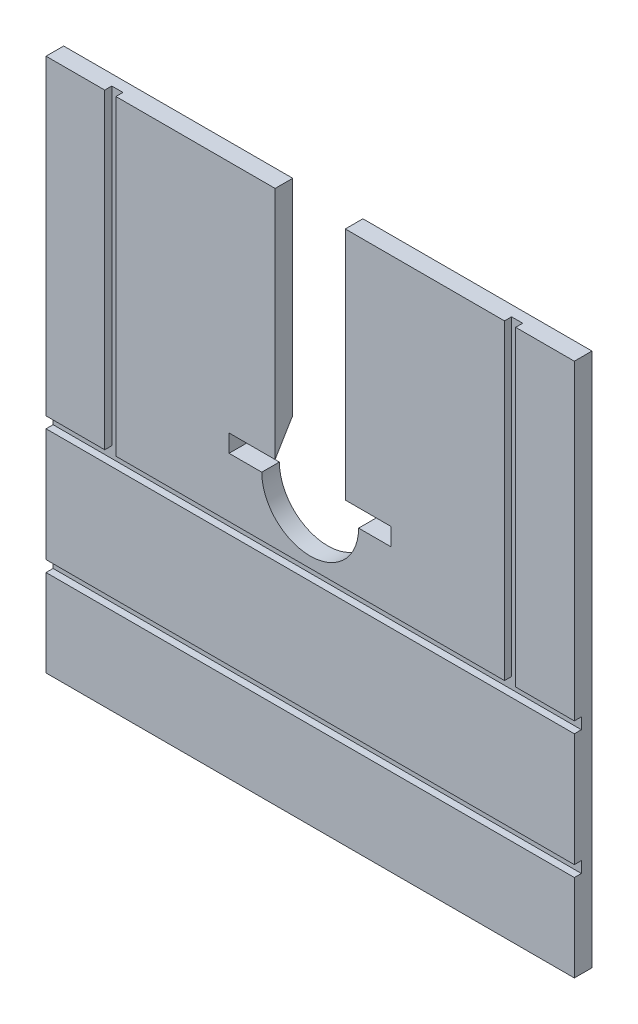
ISO-10303-21;
HEADER;
FILE_DESCRIPTION(('STEP AP214'),'2;1');
FILE_NAME('part.step','',(''),(''),'','','');
FILE_SCHEMA(('AUTOMOTIVE_DESIGN { 1 0 10303 214 1 1 1 1 }'));
ENDSEC;
DATA;
#1=APPLICATION_CONTEXT('core data for automotive mechanical design processes');
#2=APPLICATION_PROTOCOL_DEFINITION('international standard','automotive_design',2000,#1);
#3=PRODUCT_CONTEXT('',#1,'mechanical');
#4=PRODUCT('Part','Part','',(#3));
#5=PRODUCT_RELATED_PRODUCT_CATEGORY('part','',(#4));
#6=PRODUCT_DEFINITION_FORMATION('','',#4);
#7=PRODUCT_DEFINITION_CONTEXT('part definition',#1,'design');
#8=PRODUCT_DEFINITION('design','',#6,#7);
#9=PRODUCT_DEFINITION_SHAPE('','',#8);
#10=(LENGTH_UNIT() NAMED_UNIT(*) SI_UNIT(.MILLI.,.METRE.));
#11=(NAMED_UNIT(*) PLANE_ANGLE_UNIT() SI_UNIT($,.RADIAN.));
#12=(NAMED_UNIT(*) SI_UNIT($,.STERADIAN.) SOLID_ANGLE_UNIT());
#13=UNCERTAINTY_MEASURE_WITH_UNIT(LENGTH_MEASURE(1.E-05),#10,'distance_accuracy_value','');
#14=(GEOMETRIC_REPRESENTATION_CONTEXT(3) GLOBAL_UNCERTAINTY_ASSIGNED_CONTEXT((#13)) GLOBAL_UNIT_ASSIGNED_CONTEXT((#10,
#11,#12)) REPRESENTATION_CONTEXT('',''));
#15=CARTESIAN_POINT('',(0.,0.,0.));
#16=DIRECTION('',(0.,0.,1.));
#17=DIRECTION('',(1.,0.,0.));
#18=AXIS2_PLACEMENT_3D('',#15,#16,#17);
#19=CARTESIAN_POINT('',(0.,0.,30.));
#20=DIRECTION('',(0.,0.,1.));
#21=DIRECTION('',(1.,0.,0.));
#22=AXIS2_PLACEMENT_3D('',#19,#20,#21);
#23=PLANE('',#22);
#24=DIRECTION('',(0.,-1.,0.));
#25=VECTOR('',#24,1.);
#26=CARTESIAN_POINT('',(330.998590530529,-100.709392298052,30.));
#27=LINE('',#26,#25);
#28=CARTESIAN_POINT('',(330.998590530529,430.000000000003,30.));
#29=VERTEX_POINT('',#28);
#30=CARTESIAN_POINT('',(330.998590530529,-100.709392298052,30.));
#31=VERTEX_POINT('',#30);
#32=EDGE_CURVE('E368',#29,#31,#27,.T.);
#33=ORIENTED_EDGE('',*,*,#32,.F.);
#34=DIRECTION('',(-1.,0.,0.));
#35=VECTOR('',#34,1.);
#36=CARTESIAN_POINT('',(450.,430.000000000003,30.));
#37=LINE('',#36,#35);
#38=CARTESIAN_POINT('',(59.776582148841,430.000000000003,30.));
#39=VERTEX_POINT('',#38);
#40=EDGE_CURVE('E376',#29,#39,#37,.T.);
#41=ORIENTED_EDGE('',*,*,#40,.T.);
#42=DIRECTION('',(0.,-1.,0.));
#43=VECTOR('',#42,1.);
#44=CARTESIAN_POINT('',(59.776582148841,430.000000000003,30.));
#45=LINE('',#44,#43);
#46=CARTESIAN_POINT('',(59.776582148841,30.000000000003,30.));
#47=VERTEX_POINT('',#46);
#48=EDGE_CURVE('E414',#39,#47,#45,.T.);
#49=ORIENTED_EDGE('',*,*,#48,.T.);
#50=DIRECTION('',(1.,0.,0.));
#51=VECTOR('',#50,1.);
#52=CARTESIAN_POINT('',(59.776582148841,30.000000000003,30.));
#53=LINE('',#52,#51);
#54=CARTESIAN_POINT('',(82.776582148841,30.000000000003,30.));
#55=VERTEX_POINT('',#54);
#56=EDGE_CURVE('E417',#47,#55,#53,.T.);
#57=ORIENTED_EDGE('',*,*,#56,.T.);
#58=CARTESIAN_POINT('',(137.776582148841,30.000000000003,30.));
#59=VERTEX_POINT('',#58);
#60=EDGE_CURVE('E416',#55,#59,#53,.T.);
#61=ORIENTED_EDGE('',*,*,#60,.T.);
#62=DIRECTION('',(0.,-1.,0.));
#63=VECTOR('',#62,1.);
#64=CARTESIAN_POINT('',(137.776582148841,30.000000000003,30.));
#65=LINE('',#64,#63);
#66=CARTESIAN_POINT('',(137.776582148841,0.,30.));
#67=VERTEX_POINT('',#66);
#68=EDGE_CURVE('E420',#59,#67,#65,.T.);
#69=ORIENTED_EDGE('',*,*,#68,.T.);
#70=DIRECTION('',(-1.,0.,0.));
#71=VECTOR('',#70,1.);
#72=CARTESIAN_POINT('',(137.776582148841,0.,30.));
#73=LINE('',#72,#71);
#74=CARTESIAN_POINT('',(82.5,0.,30.));
#75=VERTEX_POINT('',#74);
#76=EDGE_CURVE('E422',#67,#75,#73,.T.);
#77=ORIENTED_EDGE('',*,*,#76,.T.);
#78=CARTESIAN_POINT('',(0.,0.,30.));
#79=DIRECTION('',(0.,0.,-1.));
#80=DIRECTION('',(1.,0.,0.));
#81=AXIS2_PLACEMENT_3D('',#78,#79,#80);
#82=CIRCLE('',#81,82.5);
#83=CARTESIAN_POINT('',(-82.5,0.,30.));
#84=VERTEX_POINT('',#83);
#85=EDGE_CURVE('E424',#75,#84,#82,.T.);
#86=ORIENTED_EDGE('',*,*,#85,.T.);
#87=DIRECTION('',(-1.,0.,0.));
#88=VECTOR('',#87,1.);
#89=CARTESIAN_POINT('',(-138.223417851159,0.,30.));
#90=LINE('',#89,#88);
#91=CARTESIAN_POINT('',(-138.223417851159,0.,30.));
#92=VERTEX_POINT('',#91);
#93=EDGE_CURVE('E426',#84,#92,#90,.T.);
#94=ORIENTED_EDGE('',*,*,#93,.T.);
#95=DIRECTION('',(0.,1.,0.));
#96=VECTOR('',#95,1.);
#97=CARTESIAN_POINT('',(-138.223417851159,30.000000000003,30.));
#98=LINE('',#97,#96);
#99=CARTESIAN_POINT('',(-138.223417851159,30.000000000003,30.));
#100=VERTEX_POINT('',#99);
#101=EDGE_CURVE('E428',#92,#100,#98,.T.);
#102=ORIENTED_EDGE('',*,*,#101,.T.);
#103=DIRECTION('',(1.,0.,0.));
#104=VECTOR('',#103,1.);
#105=CARTESIAN_POINT('',(-59.776582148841,30.0000000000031,30.));
#106=LINE('',#105,#104);
#107=CARTESIAN_POINT('',(-82.776582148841,30.000000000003,30.));
#108=VERTEX_POINT('',#107);
#109=EDGE_CURVE('E430',#100,#108,#106,.T.);
#110=ORIENTED_EDGE('',*,*,#109,.T.);
#111=DIRECTION('',(1.,0.,0.));
#112=VECTOR('',#111,1.);
#113=CARTESIAN_POINT('',(-82.776582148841,30.000000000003,30.));
#114=LINE('',#113,#112);
#115=CARTESIAN_POINT('',(-59.776582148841,30.0000000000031,30.));
#116=VERTEX_POINT('',#115);
#117=EDGE_CURVE('E305',#108,#116,#114,.T.);
#118=ORIENTED_EDGE('',*,*,#117,.T.);
#119=DIRECTION('',(0.,1.,0.));
#120=VECTOR('',#119,1.);
#121=CARTESIAN_POINT('',(-59.7765821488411,430.000000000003,30.));
#122=LINE('',#121,#120);
#123=CARTESIAN_POINT('',(-59.7765821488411,430.000000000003,30.));
#124=VERTEX_POINT('',#123);
#125=EDGE_CURVE('E433',#116,#124,#122,.T.);
#126=ORIENTED_EDGE('',*,*,#125,.T.);
#127=DIRECTION('',(-1.,0.,0.));
#128=VECTOR('',#127,1.);
#129=CARTESIAN_POINT('',(-59.7765821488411,430.000000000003,30.));
#130=LINE('',#129,#128);
#131=CARTESIAN_POINT('',(-330.998590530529,430.000000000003,30.));
#132=VERTEX_POINT('',#131);
#133=EDGE_CURVE('E436',#124,#132,#130,.T.);
#134=ORIENTED_EDGE('',*,*,#133,.T.);
#135=DIRECTION('',(0.,1.,0.));
#136=VECTOR('',#135,1.);
#137=CARTESIAN_POINT('',(-330.998590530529,-100.709392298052,30.));
#138=LINE('',#137,#136);
#139=CARTESIAN_POINT('',(-330.998590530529,-100.709392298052,30.));
#140=VERTEX_POINT('',#139);
#141=EDGE_CURVE('E352',#140,#132,#138,.T.);
#142=ORIENTED_EDGE('',*,*,#141,.F.);
#143=DIRECTION('',(-1.,0.,0.));
#144=VECTOR('',#143,1.);
#145=CARTESIAN_POINT('',(-450.,-100.709392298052,30.));
#146=LINE('',#145,#144);
#147=EDGE_CURVE('E384',#31,#140,#146,.T.);
#148=ORIENTED_EDGE('',*,*,#147,.F.);
#149=EDGE_LOOP('',(#33,#41,#49,#57,#61,#69,#77,#86,#94,#102,#110,#118,#126,#134,#142,#148));
#150=FACE_BOUND('',#149,.T.);
#151=ADVANCED_FACE('F34',(#150),#23,.T.);
#152=CARTESIAN_POINT('',(-450.,-100.709392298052,18.));
#153=DIRECTION('',(0.,1.,0.));
#154=DIRECTION('',(0.,0.,1.));
#155=AXIS2_PLACEMENT_3D('',#152,#153,#154);
#156=PLANE('',#155);
#157=DIRECTION('',(-1.,0.,0.));
#158=VECTOR('',#157,1.);
#159=CARTESIAN_POINT('',(-450.,-100.709392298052,18.));
#160=LINE('',#159,#158);
#161=CARTESIAN_POINT('',(330.998590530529,-100.709392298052,18.));
#162=VERTEX_POINT('',#161);
#163=CARTESIAN_POINT('',(-330.998590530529,-100.709392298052,18.));
#164=VERTEX_POINT('',#163);
#165=EDGE_CURVE('E274',#162,#164,#160,.T.);
#166=ORIENTED_EDGE('',*,*,#165,.F.);
#167=DIRECTION('',(0.,0.,1.));
#168=VECTOR('',#167,1.);
#169=CARTESIAN_POINT('',(330.998590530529,-100.709392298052,18.));
#170=LINE('',#169,#168);
#171=EDGE_CURVE('E266',#162,#31,#170,.T.);
#172=ORIENTED_EDGE('',*,*,#171,.T.);
#173=ORIENTED_EDGE('',*,*,#147,.T.);
#174=DIRECTION('',(0.,0.,1.));
#175=VECTOR('',#174,1.);
#176=CARTESIAN_POINT('',(-330.998590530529,-100.709392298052,18.));
#177=LINE('',#176,#175);
#178=EDGE_CURVE('E347',#164,#140,#177,.T.);
#179=ORIENTED_EDGE('',*,*,#178,.F.);
#180=EDGE_LOOP('',(#166,#172,#173,#179));
#181=FACE_BOUND('',#180,.T.);
#182=ADVANCED_FACE('F582',(#181),#156,.F.);
#183=DIRECTION('',(0.,1.,0.));
#184=VECTOR('',#183,1.);
#185=CARTESIAN_POINT('',(349.998590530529,430.000000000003,30.));
#186=LINE('',#185,#184);
#187=CARTESIAN_POINT('',(349.998590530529,-100.709392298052,30.));
#188=VERTEX_POINT('',#187);
#189=CARTESIAN_POINT('',(349.998590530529,430.000000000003,30.));
#190=VERTEX_POINT('',#189);
#191=EDGE_CURVE('E366',#188,#190,#186,.T.);
#192=ORIENTED_EDGE('',*,*,#191,.F.);
#193=CARTESIAN_POINT('',(450.,-100.709392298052,30.));
#194=VERTEX_POINT('',#193);
#195=EDGE_CURVE('E265',#194,#188,#146,.T.);
#196=ORIENTED_EDGE('',*,*,#195,.F.);
#197=DIRECTION('',(0.,1.,0.));
#198=VECTOR('',#197,1.);
#199=CARTESIAN_POINT('',(450.,430.000000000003,30.));
#200=LINE('',#199,#198);
#201=CARTESIAN_POINT('',(450.,430.000000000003,30.));
#202=VERTEX_POINT('',#201);
#203=EDGE_CURVE('E406',#194,#202,#200,.T.);
#204=ORIENTED_EDGE('',*,*,#203,.T.);
#205=EDGE_CURVE('E411',#202,#190,#37,.T.);
#206=ORIENTED_EDGE('',*,*,#205,.T.);
#207=EDGE_LOOP('',(#192,#196,#204,#206));
#208=FACE_BOUND('',#207,.T.);
#209=ADVANCED_FACE('F584',(#208),#23,.T.);
#210=ORIENTED_EDGE('',*,*,#195,.T.);
#211=DIRECTION('',(0.,0.,1.));
#212=VECTOR('',#211,1.);
#213=CARTESIAN_POINT('',(349.998590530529,-100.709392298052,18.));
#214=LINE('',#213,#212);
#215=CARTESIAN_POINT('',(349.998590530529,-100.709392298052,18.));
#216=VERTEX_POINT('',#215);
#217=EDGE_CURVE('E250',#216,#188,#214,.T.);
#218=ORIENTED_EDGE('',*,*,#217,.F.);
#219=CARTESIAN_POINT('',(450.,-100.709392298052,18.));
#220=VERTEX_POINT('',#219);
#221=EDGE_CURVE('E262',#220,#216,#160,.T.);
#222=ORIENTED_EDGE('',*,*,#221,.F.);
#223=DIRECTION('',(0.,0.,1.));
#224=VECTOR('',#223,1.);
#225=CARTESIAN_POINT('',(450.,-100.709392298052,18.));
#226=LINE('',#225,#224);
#227=EDGE_CURVE('E395',#220,#194,#226,.T.);
#228=ORIENTED_EDGE('',*,*,#227,.T.);
#229=EDGE_LOOP('',(#210,#218,#222,#228));
#230=FACE_BOUND('',#229,.T.);
#231=ADVANCED_FACE('F261',(#230),#156,.F.);
#232=CARTESIAN_POINT('',(-59.776582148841,30.0000000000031,30.));
#233=DIRECTION('',(0.,1.,0.));
#234=DIRECTION('',(-1.,0.,0.));
#235=AXIS2_PLACEMENT_3D('',#232,#233,#234);
#236=PLANE('',#235);
#237=DIRECTION('',(0.,0.,-1.));
#238=VECTOR('',#237,1.);
#239=CARTESIAN_POINT('',(-82.776582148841,30.000000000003,0.));
#240=LINE('',#239,#238);
#241=CARTESIAN_POINT('',(-82.776582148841,30.000000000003,0.));
#242=VERTEX_POINT('',#241);
#243=EDGE_CURVE('E322',#108,#242,#240,.T.);
#244=ORIENTED_EDGE('',*,*,#243,.F.);
#245=ORIENTED_EDGE('',*,*,#109,.F.);
#246=DIRECTION('',(0.,0.,-1.));
#247=VECTOR('',#246,1.);
#248=CARTESIAN_POINT('',(-138.223417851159,30.000000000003,30.));
#249=LINE('',#248,#247);
#250=CARTESIAN_POINT('',(-138.223417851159,30.000000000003,0.));
#251=VERTEX_POINT('',#250);
#252=EDGE_CURVE('E474',#100,#251,#249,.T.);
#253=ORIENTED_EDGE('',*,*,#252,.T.);
#254=DIRECTION('',(1.,0.,0.));
#255=VECTOR('',#254,1.);
#256=CARTESIAN_POINT('',(-59.776582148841,30.0000000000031,0.));
#257=LINE('',#256,#255);
#258=EDGE_CURVE('E462',#251,#242,#257,.T.);
#259=ORIENTED_EDGE('',*,*,#258,.T.);
#260=EDGE_LOOP('',(#244,#245,#253,#259));
#261=FACE_BOUND('',#260,.T.);
#262=ADVANCED_FACE('F558',(#261),#236,.F.);
#263=DIRECTION('',(1.,0.,0.));
#264=VECTOR('',#263,1.);
#265=CARTESIAN_POINT('',(-450.,-331.76304159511,30.));
#266=LINE('',#265,#264);
#267=CARTESIAN_POINT('',(-450.,-331.76304159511,30.));
#268=VERTEX_POINT('',#267);
#269=CARTESIAN_POINT('',(450.,-331.76304159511,30.));
#270=VERTEX_POINT('',#269);
#271=EDGE_CURVE('E300',#268,#270,#266,.T.);
#272=ORIENTED_EDGE('',*,*,#271,.F.);
#273=DIRECTION('',(0.,-1.,0.));
#274=VECTOR('',#273,1.);
#275=CARTESIAN_POINT('',(-450.,430.000000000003,30.));
#276=LINE('',#275,#274);
#277=CARTESIAN_POINT('',(-450.,-480.,30.));
#278=VERTEX_POINT('',#277);
#279=EDGE_CURVE('E404',#268,#278,#276,.T.);
#280=ORIENTED_EDGE('',*,*,#279,.T.);
#281=DIRECTION('',(1.,0.,0.));
#282=VECTOR('',#281,1.);
#283=CARTESIAN_POINT('',(450.,-480.,30.));
#284=LINE('',#283,#282);
#285=CARTESIAN_POINT('',(450.,-480.,30.));
#286=VERTEX_POINT('',#285);
#287=EDGE_CURVE('E402',#278,#286,#284,.T.);
#288=ORIENTED_EDGE('',*,*,#287,.T.);
#289=EDGE_CURVE('E407',#286,#270,#200,.T.);
#290=ORIENTED_EDGE('',*,*,#289,.T.);
#291=EDGE_LOOP('',(#272,#280,#288,#290));
#292=FACE_BOUND('',#291,.T.);
#293=ADVANCED_FACE('F593',(#292),#23,.T.);
#294=DIRECTION('',(0.,-1.,0.));
#295=VECTOR('',#294,1.);
#296=CARTESIAN_POINT('',(-349.998590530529,430.000000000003,30.));
#297=LINE('',#296,#295);
#298=CARTESIAN_POINT('',(-349.998590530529,430.000000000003,30.));
#299=VERTEX_POINT('',#298);
#300=CARTESIAN_POINT('',(-349.998590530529,-100.709392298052,30.));
#301=VERTEX_POINT('',#300);
#302=EDGE_CURVE('E355',#299,#301,#297,.T.);
#303=ORIENTED_EDGE('',*,*,#302,.F.);
#304=CARTESIAN_POINT('',(-450.,430.000000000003,30.));
#305=VERTEX_POINT('',#304);
#306=EDGE_CURVE('E435',#299,#305,#130,.T.);
#307=ORIENTED_EDGE('',*,*,#306,.T.);
#308=CARTESIAN_POINT('',(-450.,-100.709392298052,30.));
#309=VERTEX_POINT('',#308);
#310=EDGE_CURVE('E399',#305,#309,#276,.T.);
#311=ORIENTED_EDGE('',*,*,#310,.T.);
#312=EDGE_CURVE('E388',#301,#309,#146,.T.);
#313=ORIENTED_EDGE('',*,*,#312,.F.);
#314=EDGE_LOOP('',(#303,#307,#311,#313));
#315=FACE_BOUND('',#314,.T.);
#316=ADVANCED_FACE('F639',(#315),#23,.T.);
#317=CARTESIAN_POINT('',(-450.,430.000000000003,30.));
#318=DIRECTION('',(1.,0.,0.));
#319=DIRECTION('',(0.,1.,0.));
#320=AXIS2_PLACEMENT_3D('',#317,#318,#319);
#321=PLANE('',#320);
#322=ORIENTED_EDGE('',*,*,#279,.F.);
#323=DIRECTION('',(0.,0.,1.));
#324=VECTOR('',#323,1.);
#325=CARTESIAN_POINT('',(-450.,-331.76304159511,18.));
#326=LINE('',#325,#324);
#327=CARTESIAN_POINT('',(-450.,-331.76304159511,18.));
#328=VERTEX_POINT('',#327);
#329=EDGE_CURVE('E294',#328,#268,#326,.T.);
#330=ORIENTED_EDGE('',*,*,#329,.F.);
#331=DIRECTION('',(0.,-1.,0.));
#332=VECTOR('',#331,1.);
#333=CARTESIAN_POINT('',(-450.,-312.76304159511,18.));
#334=LINE('',#333,#332);
#335=CARTESIAN_POINT('',(-450.,-312.76304159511,18.));
#336=VERTEX_POINT('',#335);
#337=EDGE_CURVE('E308',#336,#328,#334,.T.);
#338=ORIENTED_EDGE('',*,*,#337,.F.);
#339=DIRECTION('',(0.,0.,1.));
#340=VECTOR('',#339,1.);
#341=CARTESIAN_POINT('',(-450.,-312.76304159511,18.));
#342=LINE('',#341,#340);
#343=CARTESIAN_POINT('',(-450.,-312.76304159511,30.));
#344=VERTEX_POINT('',#343);
#345=EDGE_CURVE('E290',#336,#344,#342,.T.);
#346=ORIENTED_EDGE('',*,*,#345,.T.);
#347=CARTESIAN_POINT('',(-450.,-119.709392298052,30.));
#348=VERTEX_POINT('',#347);
#349=EDGE_CURVE('E403',#348,#344,#276,.T.);
#350=ORIENTED_EDGE('',*,*,#349,.F.);
#351=DIRECTION('',(0.,0.,1.));
#352=VECTOR('',#351,1.);
#353=CARTESIAN_POINT('',(-450.,-119.709392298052,18.));
#354=LINE('',#353,#352);
#355=CARTESIAN_POINT('',(-450.,-119.709392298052,18.));
#356=VERTEX_POINT('',#355);
#357=EDGE_CURVE('E273',#356,#348,#354,.T.);
#358=ORIENTED_EDGE('',*,*,#357,.F.);
#359=DIRECTION('',(0.,-1.,0.));
#360=VECTOR('',#359,1.);
#361=CARTESIAN_POINT('',(-450.,-119.709392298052,18.));
#362=LINE('',#361,#360);
#363=CARTESIAN_POINT('',(-450.,-100.709392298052,18.));
#364=VERTEX_POINT('',#363);
#365=EDGE_CURVE('E284',#364,#356,#362,.T.);
#366=ORIENTED_EDGE('',*,*,#365,.F.);
#367=DIRECTION('',(0.,0.,1.));
#368=VECTOR('',#367,1.);
#369=CARTESIAN_POINT('',(-450.,-100.709392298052,18.));
#370=LINE('',#369,#368);
#371=EDGE_CURVE('E391',#364,#309,#370,.T.);
#372=ORIENTED_EDGE('',*,*,#371,.T.);
#373=ORIENTED_EDGE('',*,*,#310,.F.);
#374=DIRECTION('',(0.,0.,-1.));
#375=VECTOR('',#374,1.);
#376=CARTESIAN_POINT('',(-450.,430.000000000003,30.));
#377=LINE('',#376,#375);
#378=CARTESIAN_POINT('',(-450.,430.000000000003,0.));
#379=VERTEX_POINT('',#378);
#380=EDGE_CURVE('E438',#305,#379,#377,.T.);
#381=ORIENTED_EDGE('',*,*,#380,.T.);
#382=DIRECTION('',(0.,-1.,0.));
#383=VECTOR('',#382,1.);
#384=CARTESIAN_POINT('',(-450.,430.000000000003,0.));
#385=LINE('',#384,#383);
#386=CARTESIAN_POINT('',(-450.,-480.,0.));
#387=VERTEX_POINT('',#386);
#388=EDGE_CURVE('E394',#379,#387,#385,.T.);
#389=ORIENTED_EDGE('',*,*,#388,.T.);
#390=DIRECTION('',(0.,0.,-1.));
#391=VECTOR('',#390,1.);
#392=CARTESIAN_POINT('',(-450.,-480.,30.));
#393=LINE('',#392,#391);
#394=EDGE_CURVE('E11',#278,#387,#393,.T.);
#395=ORIENTED_EDGE('',*,*,#394,.F.);
#396=EDGE_LOOP('',(#322,#330,#338,#346,#350,#358,#366,#372,#373,#381,#389,#395));
#397=FACE_BOUND('',#396,.T.);
#398=ADVANCED_FACE('F36',(#397),#321,.F.);
#399=CARTESIAN_POINT('',(450.,-480.,30.));
#400=DIRECTION('',(0.,1.,0.));
#401=DIRECTION('',(-1.,0.,0.));
#402=AXIS2_PLACEMENT_3D('',#399,#400,#401);
#403=PLANE('',#402);
#404=DIRECTION('',(1.,0.,0.));
#405=VECTOR('',#404,1.);
#406=CARTESIAN_POINT('',(450.,-480.,0.));
#407=LINE('',#406,#405);
#408=CARTESIAN_POINT('',(450.,-480.,0.));
#409=VERTEX_POINT('',#408);
#410=EDGE_CURVE('E441',#387,#409,#407,.T.);
#411=ORIENTED_EDGE('',*,*,#410,.T.);
#412=DIRECTION('',(0.,0.,-1.));
#413=VECTOR('',#412,1.);
#414=CARTESIAN_POINT('',(450.,-480.,30.));
#415=LINE('',#414,#413);
#416=EDGE_CURVE('E42',#286,#409,#415,.T.);
#417=ORIENTED_EDGE('',*,*,#416,.F.);
#418=ORIENTED_EDGE('',*,*,#287,.F.);
#419=ORIENTED_EDGE('',*,*,#394,.T.);
#420=EDGE_LOOP('',(#411,#417,#418,#419));
#421=FACE_BOUND('',#420,.T.);
#422=ADVANCED_FACE('F634',(#421),#403,.F.);
#423=CARTESIAN_POINT('',(450.,430.000000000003,30.));
#424=DIRECTION('',(-1.,0.,0.));
#425=DIRECTION('',(0.,-1.,0.));
#426=AXIS2_PLACEMENT_3D('',#423,#424,#425);
#427=PLANE('',#426);
#428=DIRECTION('',(0.,1.,0.));
#429=VECTOR('',#428,1.);
#430=CARTESIAN_POINT('',(450.,-331.76304159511,18.));
#431=LINE('',#430,#429);
#432=CARTESIAN_POINT('',(450.,-331.76304159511,18.));
#433=VERTEX_POINT('',#432);
#434=CARTESIAN_POINT('',(450.,-312.76304159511,18.));
#435=VERTEX_POINT('',#434);
#436=EDGE_CURVE('E302',#433,#435,#431,.T.);
#437=ORIENTED_EDGE('',*,*,#436,.F.);
#438=DIRECTION('',(0.,0.,1.));
#439=VECTOR('',#438,1.);
#440=CARTESIAN_POINT('',(450.,-331.76304159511,18.));
#441=LINE('',#440,#439);
#442=EDGE_CURVE('E296',#433,#270,#441,.T.);
#443=ORIENTED_EDGE('',*,*,#442,.T.);
#444=ORIENTED_EDGE('',*,*,#289,.F.);
#445=ORIENTED_EDGE('',*,*,#416,.T.);
#446=DIRECTION('',(0.,1.,0.));
#447=VECTOR('',#446,1.);
#448=CARTESIAN_POINT('',(450.,430.000000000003,0.));
#449=LINE('',#448,#447);
#450=CARTESIAN_POINT('',(450.,430.000000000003,0.));
#451=VERTEX_POINT('',#450);
#452=EDGE_CURVE('E443',#409,#451,#449,.T.);
#453=ORIENTED_EDGE('',*,*,#452,.T.);
#454=DIRECTION('',(0.,0.,-1.));
#455=VECTOR('',#454,1.);
#456=CARTESIAN_POINT('',(450.,430.000000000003,30.));
#457=LINE('',#456,#455);
#458=EDGE_CURVE('E495',#202,#451,#457,.T.);
#459=ORIENTED_EDGE('',*,*,#458,.F.);
#460=ORIENTED_EDGE('',*,*,#203,.F.);
#461=ORIENTED_EDGE('',*,*,#227,.F.);
#462=DIRECTION('',(0.,1.,0.));
#463=VECTOR('',#462,1.);
#464=CARTESIAN_POINT('',(450.,-100.709392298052,18.));
#465=LINE('',#464,#463);
#466=CARTESIAN_POINT('',(450.,-119.709392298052,18.));
#467=VERTEX_POINT('',#466);
#468=EDGE_CURVE('E272',#467,#220,#465,.T.);
#469=ORIENTED_EDGE('',*,*,#468,.F.);
#470=DIRECTION('',(0.,0.,1.));
#471=VECTOR('',#470,1.);
#472=CARTESIAN_POINT('',(450.,-119.709392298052,18.));
#473=LINE('',#472,#471);
#474=CARTESIAN_POINT('',(450.,-119.709392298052,30.));
#475=VERTEX_POINT('',#474);
#476=EDGE_CURVE('E277',#467,#475,#473,.T.);
#477=ORIENTED_EDGE('',*,*,#476,.T.);
#478=CARTESIAN_POINT('',(450.,-312.76304159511,30.));
#479=VERTEX_POINT('',#478);
#480=EDGE_CURVE('E410',#479,#475,#200,.T.);
#481=ORIENTED_EDGE('',*,*,#480,.F.);
#482=DIRECTION('',(0.,0.,1.));
#483=VECTOR('',#482,1.);
#484=CARTESIAN_POINT('',(450.,-312.76304159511,18.));
#485=LINE('',#484,#483);
#486=EDGE_CURVE('E288',#435,#479,#485,.T.);
#487=ORIENTED_EDGE('',*,*,#486,.F.);
#488=EDGE_LOOP('',(#437,#443,#444,#445,#453,#459,#460,#461,#469,#477,#481,#487));
#489=FACE_BOUND('',#488,.T.);
#490=ADVANCED_FACE('F503',(#489),#427,.F.);
#491=CARTESIAN_POINT('',(450.,430.000000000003,30.));
#492=DIRECTION('',(0.,-1.,0.));
#493=DIRECTION('',(1.,0.,0.));
#494=AXIS2_PLACEMENT_3D('',#491,#492,#493);
#495=PLANE('',#494);
#496=ORIENTED_EDGE('',*,*,#40,.F.);
#497=DIRECTION('',(0.,0.,1.));
#498=VECTOR('',#497,1.);
#499=CARTESIAN_POINT('',(330.998590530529,430.000000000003,18.));
#500=LINE('',#499,#498);
#501=CARTESIAN_POINT('',(330.998590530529,430.000000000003,18.));
#502=VERTEX_POINT('',#501);
#503=EDGE_CURVE('E357',#502,#29,#500,.T.);
#504=ORIENTED_EDGE('',*,*,#503,.F.);
#505=DIRECTION('',(-1.,0.,0.));
#506=VECTOR('',#505,1.);
#507=CARTESIAN_POINT('',(330.998590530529,430.000000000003,18.));
#508=LINE('',#507,#506);
#509=CARTESIAN_POINT('',(349.998590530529,430.000000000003,18.));
#510=VERTEX_POINT('',#509);
#511=EDGE_CURVE('E256',#510,#502,#508,.T.);
#512=ORIENTED_EDGE('',*,*,#511,.F.);
#513=DIRECTION('',(0.,0.,1.));
#514=VECTOR('',#513,1.);
#515=CARTESIAN_POINT('',(349.998590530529,430.000000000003,18.));
#516=LINE('',#515,#514);
#517=EDGE_CURVE('E253',#510,#190,#516,.T.);
#518=ORIENTED_EDGE('',*,*,#517,.T.);
#519=ORIENTED_EDGE('',*,*,#205,.F.);
#520=ORIENTED_EDGE('',*,*,#458,.T.);
#521=DIRECTION('',(-1.,0.,0.));
#522=VECTOR('',#521,1.);
#523=CARTESIAN_POINT('',(450.,430.000000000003,0.));
#524=LINE('',#523,#522);
#525=CARTESIAN_POINT('',(59.776582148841,430.000000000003,0.));
#526=VERTEX_POINT('',#525);
#527=EDGE_CURVE('E445',#451,#526,#524,.T.);
#528=ORIENTED_EDGE('',*,*,#527,.T.);
#529=DIRECTION('',(0.,0.,-1.));
#530=VECTOR('',#529,1.);
#531=CARTESIAN_POINT('',(59.776582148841,430.000000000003,30.));
#532=LINE('',#531,#530);
#533=EDGE_CURVE('E492',#39,#526,#532,.T.);
#534=ORIENTED_EDGE('',*,*,#533,.F.);
#535=EDGE_LOOP('',(#496,#504,#512,#518,#519,#520,#528,#534));
#536=FACE_BOUND('',#535,.T.);
#537=ADVANCED_FACE('F374',(#536),#495,.F.);
#538=CARTESIAN_POINT('',(59.776582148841,430.000000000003,30.));
#539=DIRECTION('',(1.,0.,0.));
#540=DIRECTION('',(0.,1.,0.));
#541=AXIS2_PLACEMENT_3D('',#538,#539,#540);
#542=PLANE('',#541);
#543=DIRECTION('',(0.,-1.,0.));
#544=VECTOR('',#543,1.);
#545=CARTESIAN_POINT('',(59.776582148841,430.000000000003,0.));
#546=LINE('',#545,#544);
#547=CARTESIAN_POINT('',(59.776582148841,79.8468431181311,0.));
#548=VERTEX_POINT('',#547);
#549=EDGE_CURVE('E447',#526,#548,#546,.T.);
#550=ORIENTED_EDGE('',*,*,#549,.T.);
#551=DIRECTION('',(0.,0.856795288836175,-0.515656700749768));
#552=VECTOR('',#551,1.);
#553=CARTESIAN_POINT('',(59.776582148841,30.000000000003,30.));
#554=LINE('',#553,#552);
#555=EDGE_CURVE('E332',#47,#548,#554,.T.);
#556=ORIENTED_EDGE('',*,*,#555,.F.);
#557=ORIENTED_EDGE('',*,*,#48,.F.);
#558=ORIENTED_EDGE('',*,*,#533,.T.);
#559=EDGE_LOOP('',(#550,#556,#557,#558));
#560=FACE_BOUND('',#559,.T.);
#561=ADVANCED_FACE('F516',(#560),#542,.F.);
#562=CARTESIAN_POINT('',(59.776582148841,30.000000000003,30.));
#563=DIRECTION('',(0.,1.,0.));
#564=DIRECTION('',(0.,0.,1.));
#565=AXIS2_PLACEMENT_3D('',#562,#563,#564);
#566=PLANE('',#565);
#567=ORIENTED_EDGE('',*,*,#60,.F.);
#568=DIRECTION('',(0.,0.,1.));
#569=VECTOR('',#568,1.);
#570=CARTESIAN_POINT('',(82.776582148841,30.000000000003,0.));
#571=LINE('',#570,#569);
#572=CARTESIAN_POINT('',(82.776582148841,30.000000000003,0.));
#573=VERTEX_POINT('',#572);
#574=EDGE_CURVE('E334',#573,#55,#571,.T.);
#575=ORIENTED_EDGE('',*,*,#574,.F.);
#576=DIRECTION('',(1.,0.,0.));
#577=VECTOR('',#576,1.);
#578=CARTESIAN_POINT('',(59.776582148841,30.000000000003,0.));
#579=LINE('',#578,#577);
#580=CARTESIAN_POINT('',(137.776582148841,30.000000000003,0.));
#581=VERTEX_POINT('',#580);
#582=EDGE_CURVE('E450',#573,#581,#579,.T.);
#583=ORIENTED_EDGE('',*,*,#582,.T.);
#584=DIRECTION('',(0.,0.,-1.));
#585=VECTOR('',#584,1.);
#586=CARTESIAN_POINT('',(137.776582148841,30.000000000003,30.));
#587=LINE('',#586,#585);
#588=EDGE_CURVE('E489',#59,#581,#587,.T.);
#589=ORIENTED_EDGE('',*,*,#588,.F.);
#590=EDGE_LOOP('',(#567,#575,#583,#589));
#591=FACE_BOUND('',#590,.T.);
#592=ADVANCED_FACE('F528',(#591),#566,.F.);
#593=CARTESIAN_POINT('',(137.776582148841,30.000000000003,30.));
#594=DIRECTION('',(1.,0.,0.));
#595=DIRECTION('',(0.,0.,-1.));
#596=AXIS2_PLACEMENT_3D('',#593,#594,#595);
#597=PLANE('',#596);
#598=DIRECTION('',(0.,-1.,0.));
#599=VECTOR('',#598,1.);
#600=CARTESIAN_POINT('',(137.776582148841,30.000000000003,0.));
#601=LINE('',#600,#599);
#602=CARTESIAN_POINT('',(137.776582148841,0.,0.));
#603=VERTEX_POINT('',#602);
#604=EDGE_CURVE('E452',#581,#603,#601,.T.);
#605=ORIENTED_EDGE('',*,*,#604,.T.);
#606=DIRECTION('',(0.,0.,-1.));
#607=VECTOR('',#606,1.);
#608=CARTESIAN_POINT('',(137.776582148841,0.,30.));
#609=LINE('',#608,#607);
#610=EDGE_CURVE('E486',#67,#603,#609,.T.);
#611=ORIENTED_EDGE('',*,*,#610,.F.);
#612=ORIENTED_EDGE('',*,*,#68,.F.);
#613=ORIENTED_EDGE('',*,*,#588,.T.);
#614=EDGE_LOOP('',(#605,#611,#612,#613));
#615=FACE_BOUND('',#614,.T.);
#616=ADVANCED_FACE('F533',(#615),#597,.F.);
#617=CARTESIAN_POINT('',(137.776582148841,0.,30.));
#618=DIRECTION('',(0.,-1.,0.));
#619=DIRECTION('',(0.,0.,-1.));
#620=AXIS2_PLACEMENT_3D('',#617,#618,#619);
#621=PLANE('',#620);
#622=DIRECTION('',(-1.,0.,0.));
#623=VECTOR('',#622,1.);
#624=CARTESIAN_POINT('',(137.776582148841,0.,0.));
#625=LINE('',#624,#623);
#626=CARTESIAN_POINT('',(82.5,0.,0.));
#627=VERTEX_POINT('',#626);
#628=EDGE_CURVE('E454',#603,#627,#625,.T.);
#629=ORIENTED_EDGE('',*,*,#628,.T.);
#630=DIRECTION('',(0.,0.,-1.));
#631=VECTOR('',#630,1.);
#632=CARTESIAN_POINT('',(82.5,0.,30.));
#633=LINE('',#632,#631);
#634=EDGE_CURVE('E483',#75,#627,#633,.T.);
#635=ORIENTED_EDGE('',*,*,#634,.F.);
#636=ORIENTED_EDGE('',*,*,#76,.F.);
#637=ORIENTED_EDGE('',*,*,#610,.T.);
#638=EDGE_LOOP('',(#629,#635,#636,#637));
#639=FACE_BOUND('',#638,.T.);
#640=ADVANCED_FACE('F539',(#639),#621,.F.);
#641=CARTESIAN_POINT('',(0.,0.,30.));
#642=DIRECTION('',(0.,0.,-1.));
#643=DIRECTION('',(-1.,0.,0.));
#644=AXIS2_PLACEMENT_3D('',#641,#642,#643);
#645=CYLINDRICAL_SURFACE('',#644,82.5);
#646=CARTESIAN_POINT('',(0.,0.,0.));
#647=DIRECTION('',(0.,0.,-1.));
#648=DIRECTION('',(1.,0.,0.));
#649=AXIS2_PLACEMENT_3D('',#646,#647,#648);
#650=CIRCLE('',#649,82.5);
#651=CARTESIAN_POINT('',(-82.5,0.,0.));
#652=VERTEX_POINT('',#651);
#653=EDGE_CURVE('E456',#627,#652,#650,.T.);
#654=ORIENTED_EDGE('',*,*,#653,.T.);
#655=DIRECTION('',(0.,0.,-1.));
#656=VECTOR('',#655,1.);
#657=CARTESIAN_POINT('',(-82.5,0.,30.));
#658=LINE('',#657,#656);
#659=EDGE_CURVE('E480',#84,#652,#658,.T.);
#660=ORIENTED_EDGE('',*,*,#659,.F.);
#661=ORIENTED_EDGE('',*,*,#85,.F.);
#662=ORIENTED_EDGE('',*,*,#634,.T.);
#663=EDGE_LOOP('',(#654,#660,#661,#662));
#664=FACE_BOUND('',#663,.T.);
#665=ADVANCED_FACE('F543',(#664),#645,.F.);
#666=CARTESIAN_POINT('',(-138.223417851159,0.,30.));
#667=DIRECTION('',(0.,-1.,0.));
#668=DIRECTION('',(0.,0.,-1.));
#669=AXIS2_PLACEMENT_3D('',#666,#667,#668);
#670=PLANE('',#669);
#671=DIRECTION('',(-1.,0.,0.));
#672=VECTOR('',#671,1.);
#673=CARTESIAN_POINT('',(-138.223417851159,0.,0.));
#674=LINE('',#673,#672);
#675=CARTESIAN_POINT('',(-138.223417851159,0.,0.));
#676=VERTEX_POINT('',#675);
#677=EDGE_CURVE('E458',#652,#676,#674,.T.);
#678=ORIENTED_EDGE('',*,*,#677,.T.);
#679=DIRECTION('',(0.,0.,-1.));
#680=VECTOR('',#679,1.);
#681=CARTESIAN_POINT('',(-138.223417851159,0.,30.));
#682=LINE('',#681,#680);
#683=EDGE_CURVE('E477',#92,#676,#682,.T.);
#684=ORIENTED_EDGE('',*,*,#683,.F.);
#685=ORIENTED_EDGE('',*,*,#93,.F.);
#686=ORIENTED_EDGE('',*,*,#659,.T.);
#687=EDGE_LOOP('',(#678,#684,#685,#686));
#688=FACE_BOUND('',#687,.T.);
#689=ADVANCED_FACE('F548',(#688),#670,.F.);
#690=CARTESIAN_POINT('',(-138.223417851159,30.000000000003,30.));
#691=DIRECTION('',(-1.,0.,0.));
#692=DIRECTION('',(0.,0.,1.));
#693=AXIS2_PLACEMENT_3D('',#690,#691,#692);
#694=PLANE('',#693);
#695=DIRECTION('',(0.,1.,0.));
#696=VECTOR('',#695,1.);
#697=CARTESIAN_POINT('',(-138.223417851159,30.000000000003,0.));
#698=LINE('',#697,#696);
#699=EDGE_CURVE('E460',#676,#251,#698,.T.);
#700=ORIENTED_EDGE('',*,*,#699,.T.);
#701=ORIENTED_EDGE('',*,*,#252,.F.);
#702=ORIENTED_EDGE('',*,*,#101,.F.);
#703=ORIENTED_EDGE('',*,*,#683,.T.);
#704=EDGE_LOOP('',(#700,#701,#702,#703));
#705=FACE_BOUND('',#704,.T.);
#706=ADVANCED_FACE('F553',(#705),#694,.F.);
#707=CARTESIAN_POINT('',(-59.7765821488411,430.000000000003,30.));
#708=DIRECTION('',(-1.,0.,0.));
#709=DIRECTION('',(0.,-1.,0.));
#710=AXIS2_PLACEMENT_3D('',#707,#708,#709);
#711=PLANE('',#710);
#712=ORIENTED_EDGE('',*,*,#125,.F.);
#713=DIRECTION('',(0.,-0.856795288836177,0.515656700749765));
#714=VECTOR('',#713,1.);
#715=CARTESIAN_POINT('',(-59.776582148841,30.0000000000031,30.));
#716=LINE('',#715,#714);
#717=CARTESIAN_POINT('',(-59.776582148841,79.8468431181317,0.));
#718=VERTEX_POINT('',#717);
#719=EDGE_CURVE('E320',#718,#116,#716,.T.);
#720=ORIENTED_EDGE('',*,*,#719,.F.);
#721=DIRECTION('',(0.,1.,0.));
#722=VECTOR('',#721,1.);
#723=CARTESIAN_POINT('',(-59.7765821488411,430.000000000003,0.));
#724=LINE('',#723,#722);
#725=CARTESIAN_POINT('',(-59.7765821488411,430.000000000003,0.));
#726=VERTEX_POINT('',#725);
#727=EDGE_CURVE('E465',#718,#726,#724,.T.);
#728=ORIENTED_EDGE('',*,*,#727,.T.);
#729=DIRECTION('',(0.,0.,-1.));
#730=VECTOR('',#729,1.);
#731=CARTESIAN_POINT('',(-59.7765821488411,430.000000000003,30.));
#732=LINE('',#731,#730);
#733=EDGE_CURVE('E471',#124,#726,#732,.T.);
#734=ORIENTED_EDGE('',*,*,#733,.F.);
#735=EDGE_LOOP('',(#712,#720,#728,#734));
#736=FACE_BOUND('',#735,.T.);
#737=ADVANCED_FACE('F571',(#736),#711,.F.);
#738=CARTESIAN_POINT('',(-59.7765821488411,430.000000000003,30.));
#739=DIRECTION('',(0.,-1.,0.));
#740=DIRECTION('',(1.,0.,0.));
#741=AXIS2_PLACEMENT_3D('',#738,#739,#740);
#742=PLANE('',#741);
#743=DIRECTION('',(-1.,0.,0.));
#744=VECTOR('',#743,1.);
#745=CARTESIAN_POINT('',(-330.998590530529,430.000000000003,18.));
#746=LINE('',#745,#744);
#747=CARTESIAN_POINT('',(-330.998590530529,430.000000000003,18.));
#748=VERTEX_POINT('',#747);
#749=CARTESIAN_POINT('',(-349.998590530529,430.000000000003,18.));
#750=VERTEX_POINT('',#749);
#751=EDGE_CURVE('E354',#748,#750,#746,.T.);
#752=ORIENTED_EDGE('',*,*,#751,.F.);
#753=DIRECTION('',(0.,0.,1.));
#754=VECTOR('',#753,1.);
#755=CARTESIAN_POINT('',(-330.998590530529,430.000000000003,18.));
#756=LINE('',#755,#754);
#757=EDGE_CURVE('E335',#748,#132,#756,.T.);
#758=ORIENTED_EDGE('',*,*,#757,.T.);
#759=ORIENTED_EDGE('',*,*,#133,.F.);
#760=ORIENTED_EDGE('',*,*,#733,.T.);
#761=DIRECTION('',(-1.,0.,0.));
#762=VECTOR('',#761,1.);
#763=CARTESIAN_POINT('',(-59.7765821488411,430.000000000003,0.));
#764=LINE('',#763,#762);
#765=EDGE_CURVE('E467',#726,#379,#764,.T.);
#766=ORIENTED_EDGE('',*,*,#765,.T.);
#767=ORIENTED_EDGE('',*,*,#380,.F.);
#768=ORIENTED_EDGE('',*,*,#306,.F.);
#769=DIRECTION('',(0.,0.,1.));
#770=VECTOR('',#769,1.);
#771=CARTESIAN_POINT('',(-349.998590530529,430.000000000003,18.));
#772=LINE('',#771,#770);
#773=EDGE_CURVE('E341',#750,#299,#772,.T.);
#774=ORIENTED_EDGE('',*,*,#773,.F.);
#775=EDGE_LOOP('',(#752,#758,#759,#760,#766,#767,#768,#774));
#776=FACE_BOUND('',#775,.T.);
#777=ADVANCED_FACE('F576',(#776),#742,.F.);
#778=DIRECTION('',(-1.,0.,0.));
#779=VECTOR('',#778,1.);
#780=CARTESIAN_POINT('',(450.,-312.76304159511,30.));
#781=LINE('',#780,#779);
#782=EDGE_CURVE('E303',#479,#344,#781,.T.);
#783=ORIENTED_EDGE('',*,*,#782,.F.);
#784=ORIENTED_EDGE('',*,*,#480,.T.);
#785=DIRECTION('',(1.,0.,0.));
#786=VECTOR('',#785,1.);
#787=CARTESIAN_POINT('',(450.,-119.709392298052,30.));
#788=LINE('',#787,#786);
#789=EDGE_CURVE('E299',#348,#475,#788,.T.);
#790=ORIENTED_EDGE('',*,*,#789,.F.);
#791=ORIENTED_EDGE('',*,*,#349,.T.);
#792=EDGE_LOOP('',(#783,#784,#790,#791));
#793=FACE_BOUND('',#792,.T.);
#794=ADVANCED_FACE('F594',(#793),#23,.T.);
#795=CARTESIAN_POINT('',(0.,0.,0.));
#796=DIRECTION('',(0.,0.,1.));
#797=DIRECTION('',(1.,0.,0.));
#798=AXIS2_PLACEMENT_3D('',#795,#796,#797);
#799=PLANE('',#798);
#800=DIRECTION('',(0.,-1.,0.));
#801=VECTOR('',#800,1.);
#802=CARTESIAN_POINT('',(82.776582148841,79.8468431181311,0.));
#803=LINE('',#802,#801);
#804=CARTESIAN_POINT('',(82.776582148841,79.8468431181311,0.));
#805=VERTEX_POINT('',#804);
#806=EDGE_CURVE('E331',#805,#573,#803,.T.);
#807=ORIENTED_EDGE('',*,*,#806,.F.);
#808=DIRECTION('',(-1.,0.,0.));
#809=VECTOR('',#808,1.);
#810=CARTESIAN_POINT('',(82.776582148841,79.8468431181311,0.));
#811=LINE('',#810,#809);
#812=EDGE_CURVE('E323',#805,#548,#811,.T.);
#813=ORIENTED_EDGE('',*,*,#812,.T.);
#814=ORIENTED_EDGE('',*,*,#549,.F.);
#815=ORIENTED_EDGE('',*,*,#527,.F.);
#816=ORIENTED_EDGE('',*,*,#452,.F.);
#817=ORIENTED_EDGE('',*,*,#410,.F.);
#818=ORIENTED_EDGE('',*,*,#388,.F.);
#819=ORIENTED_EDGE('',*,*,#765,.F.);
#820=ORIENTED_EDGE('',*,*,#727,.F.);
#821=DIRECTION('',(1.,0.,0.));
#822=VECTOR('',#821,1.);
#823=CARTESIAN_POINT('',(-82.776582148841,79.8468431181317,0.));
#824=LINE('',#823,#822);
#825=CARTESIAN_POINT('',(-82.776582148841,79.8468431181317,0.));
#826=VERTEX_POINT('',#825);
#827=EDGE_CURVE('E315',#826,#718,#824,.T.);
#828=ORIENTED_EDGE('',*,*,#827,.F.);
#829=DIRECTION('',(0.,1.,0.));
#830=VECTOR('',#829,1.);
#831=CARTESIAN_POINT('',(-82.776582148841,79.8468431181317,0.));
#832=LINE('',#831,#830);
#833=EDGE_CURVE('E326',#242,#826,#832,.T.);
#834=ORIENTED_EDGE('',*,*,#833,.F.);
#835=ORIENTED_EDGE('',*,*,#258,.F.);
#836=ORIENTED_EDGE('',*,*,#699,.F.);
#837=ORIENTED_EDGE('',*,*,#677,.F.);
#838=ORIENTED_EDGE('',*,*,#653,.F.);
#839=ORIENTED_EDGE('',*,*,#628,.F.);
#840=ORIENTED_EDGE('',*,*,#604,.F.);
#841=ORIENTED_EDGE('',*,*,#582,.F.);
#842=EDGE_LOOP('',(#807,#813,#814,#815,#816,#817,#818,#819,#820,#828,#834,#835,#836,#837,#838,
#839,#840,#841));
#843=FACE_BOUND('',#842,.T.);
#844=ADVANCED_FACE('F510',(#843),#799,.F.);
#845=CARTESIAN_POINT('',(-349.998590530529,-100.709392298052,18.));
#846=VERTEX_POINT('',#845);
#847=EDGE_CURVE('E276',#846,#364,#160,.T.);
#848=ORIENTED_EDGE('',*,*,#847,.F.);
#849=DIRECTION('',(0.,0.,1.));
#850=VECTOR('',#849,1.);
#851=CARTESIAN_POINT('',(-349.998590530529,-100.709392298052,18.));
#852=LINE('',#851,#850);
#853=EDGE_CURVE('E343',#846,#301,#852,.T.);
#854=ORIENTED_EDGE('',*,*,#853,.T.);
#855=ORIENTED_EDGE('',*,*,#312,.T.);
#856=ORIENTED_EDGE('',*,*,#371,.F.);
#857=EDGE_LOOP('',(#848,#854,#855,#856));
#858=FACE_BOUND('',#857,.T.);
#859=ADVANCED_FACE('F586',(#858),#156,.F.);
#860=CARTESIAN_POINT('',(450.,-119.709392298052,18.));
#861=DIRECTION('',(0.,-1.,0.));
#862=DIRECTION('',(1.,0.,0.));
#863=AXIS2_PLACEMENT_3D('',#860,#861,#862);
#864=PLANE('',#863);
#865=ORIENTED_EDGE('',*,*,#789,.T.);
#866=ORIENTED_EDGE('',*,*,#476,.F.);
#867=DIRECTION('',(1.,0.,0.));
#868=VECTOR('',#867,1.);
#869=CARTESIAN_POINT('',(450.,-119.709392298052,18.));
#870=LINE('',#869,#868);
#871=EDGE_CURVE('E283',#356,#467,#870,.T.);
#872=ORIENTED_EDGE('',*,*,#871,.F.);
#873=ORIENTED_EDGE('',*,*,#357,.T.);
#874=EDGE_LOOP('',(#865,#866,#872,#873));
#875=FACE_BOUND('',#874,.T.);
#876=ADVANCED_FACE('F599',(#875),#864,.F.);
#877=CARTESIAN_POINT('',(0.,0.,18.));
#878=DIRECTION('',(0.,0.,-1.));
#879=DIRECTION('',(-1.,0.,0.));
#880=AXIS2_PLACEMENT_3D('',#877,#878,#879);
#881=PLANE('',#880);
#882=ORIENTED_EDGE('',*,*,#365,.T.);
#883=ORIENTED_EDGE('',*,*,#871,.T.);
#884=ORIENTED_EDGE('',*,*,#468,.T.);
#885=ORIENTED_EDGE('',*,*,#221,.T.);
#886=DIRECTION('',(0.,1.,0.));
#887=VECTOR('',#886,1.);
#888=CARTESIAN_POINT('',(349.998590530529,430.000000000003,18.));
#889=LINE('',#888,#887);
#890=EDGE_CURVE('E247',#216,#510,#889,.T.);
#891=ORIENTED_EDGE('',*,*,#890,.T.);
#892=ORIENTED_EDGE('',*,*,#511,.T.);
#893=DIRECTION('',(0.,-1.,0.));
#894=VECTOR('',#893,1.);
#895=CARTESIAN_POINT('',(330.998590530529,-100.709392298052,18.));
#896=LINE('',#895,#894);
#897=EDGE_CURVE('E49',#502,#162,#896,.T.);
#898=ORIENTED_EDGE('',*,*,#897,.T.);
#899=ORIENTED_EDGE('',*,*,#165,.T.);
#900=DIRECTION('',(0.,1.,0.));
#901=VECTOR('',#900,1.);
#902=CARTESIAN_POINT('',(-330.998590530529,-100.709392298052,18.));
#903=LINE('',#902,#901);
#904=EDGE_CURVE('E344',#164,#748,#903,.T.);
#905=ORIENTED_EDGE('',*,*,#904,.T.);
#906=ORIENTED_EDGE('',*,*,#751,.T.);
#907=DIRECTION('',(0.,-1.,0.));
#908=VECTOR('',#907,1.);
#909=CARTESIAN_POINT('',(-349.998590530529,430.000000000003,18.));
#910=LINE('',#909,#908);
#911=EDGE_CURVE('E56',#750,#846,#910,.T.);
#912=ORIENTED_EDGE('',*,*,#911,.T.);
#913=ORIENTED_EDGE('',*,*,#847,.T.);
#914=EDGE_LOOP('',(#882,#883,#884,#885,#891,#892,#898,#899,#905,#906,#912,#913));
#915=FACE_BOUND('',#914,.T.);
#916=ADVANCED_FACE('F269',(#915),#881,.F.);
#917=CARTESIAN_POINT('',(-450.,-331.76304159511,18.));
#918=DIRECTION('',(0.,-1.,0.));
#919=DIRECTION('',(0.,0.,-1.));
#920=AXIS2_PLACEMENT_3D('',#917,#918,#919);
#921=PLANE('',#920);
#922=ORIENTED_EDGE('',*,*,#271,.T.);
#923=ORIENTED_EDGE('',*,*,#442,.F.);
#924=DIRECTION('',(1.,0.,0.));
#925=VECTOR('',#924,1.);
#926=CARTESIAN_POINT('',(-450.,-331.76304159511,18.));
#927=LINE('',#926,#925);
#928=EDGE_CURVE('E291',#328,#433,#927,.T.);
#929=ORIENTED_EDGE('',*,*,#928,.F.);
#930=ORIENTED_EDGE('',*,*,#329,.T.);
#931=EDGE_LOOP('',(#922,#923,#929,#930));
#932=FACE_BOUND('',#931,.T.);
#933=ADVANCED_FACE('F630',(#932),#921,.F.);
#934=CARTESIAN_POINT('',(450.,-312.76304159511,18.));
#935=DIRECTION('',(0.,1.,0.));
#936=DIRECTION('',(-1.,0.,0.));
#937=AXIS2_PLACEMENT_3D('',#934,#935,#936);
#938=PLANE('',#937);
#939=ORIENTED_EDGE('',*,*,#782,.T.);
#940=ORIENTED_EDGE('',*,*,#345,.F.);
#941=DIRECTION('',(-1.,0.,0.));
#942=VECTOR('',#941,1.);
#943=CARTESIAN_POINT('',(450.,-312.76304159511,18.));
#944=LINE('',#943,#942);
#945=EDGE_CURVE('E310',#435,#336,#944,.T.);
#946=ORIENTED_EDGE('',*,*,#945,.F.);
#947=ORIENTED_EDGE('',*,*,#486,.T.);
#948=EDGE_LOOP('',(#939,#940,#946,#947));
#949=FACE_BOUND('',#948,.T.);
#950=ADVANCED_FACE('F623',(#949),#938,.F.);
#951=CARTESIAN_POINT('',(0.,0.,18.));
#952=DIRECTION('',(0.,0.,1.));
#953=DIRECTION('',(1.,0.,0.));
#954=AXIS2_PLACEMENT_3D('',#951,#952,#953);
#955=PLANE('',#954);
#956=ORIENTED_EDGE('',*,*,#436,.T.);
#957=ORIENTED_EDGE('',*,*,#945,.T.);
#958=ORIENTED_EDGE('',*,*,#337,.T.);
#959=ORIENTED_EDGE('',*,*,#928,.T.);
#960=EDGE_LOOP('',(#956,#957,#958,#959));
#961=FACE_BOUND('',#960,.T.);
#962=ADVANCED_FACE('F626',(#961),#955,.T.);
#963=CARTESIAN_POINT('',(-82.776582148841,30.000000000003,30.));
#964=DIRECTION('',(0.,0.515656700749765,0.856795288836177));
#965=DIRECTION('',(0.,-0.856795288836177,0.515656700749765));
#966=AXIS2_PLACEMENT_3D('',#963,#964,#965);
#967=PLANE('',#966);
#968=ORIENTED_EDGE('',*,*,#719,.T.);
#969=ORIENTED_EDGE('',*,*,#117,.F.);
#970=DIRECTION('',(0.,-0.856795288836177,0.515656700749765));
#971=VECTOR('',#970,1.);
#972=CARTESIAN_POINT('',(-82.776582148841,30.000000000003,30.));
#973=LINE('',#972,#971);
#974=EDGE_CURVE('E317',#826,#108,#973,.T.);
#975=ORIENTED_EDGE('',*,*,#974,.F.);
#976=ORIENTED_EDGE('',*,*,#827,.T.);
#977=EDGE_LOOP('',(#968,#969,#975,#976));
#978=FACE_BOUND('',#977,.T.);
#979=ADVANCED_FACE('F568',(#978),#967,.F.);
#980=CARTESIAN_POINT('',(-82.776582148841,0.,0.));
#981=DIRECTION('',(1.,0.,0.));
#982=DIRECTION('',(0.,1.,0.));
#983=AXIS2_PLACEMENT_3D('',#980,#981,#982);
#984=PLANE('',#983);
#985=ORIENTED_EDGE('',*,*,#243,.T.);
#986=ORIENTED_EDGE('',*,*,#833,.T.);
#987=ORIENTED_EDGE('',*,*,#974,.T.);
#988=EDGE_LOOP('',(#985,#986,#987));
#989=FACE_BOUND('',#988,.T.);
#990=ADVANCED_FACE('F561',(#989),#984,.T.);
#991=CARTESIAN_POINT('',(82.776582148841,30.000000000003,30.));
#992=DIRECTION('',(0.,0.515656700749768,0.856795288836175));
#993=DIRECTION('',(0.,-0.856795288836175,0.515656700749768));
#994=AXIS2_PLACEMENT_3D('',#991,#992,#993);
#995=PLANE('',#994);
#996=ORIENTED_EDGE('',*,*,#555,.T.);
#997=ORIENTED_EDGE('',*,*,#812,.F.);
#998=DIRECTION('',(0.,0.856795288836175,-0.515656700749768));
#999=VECTOR('',#998,1.);
#1000=CARTESIAN_POINT('',(82.776582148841,30.000000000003,30.));
#1001=LINE('',#1000,#999);
#1002=EDGE_CURVE('E337',#55,#805,#1001,.T.);
#1003=ORIENTED_EDGE('',*,*,#1002,.F.);
#1004=ORIENTED_EDGE('',*,*,#56,.F.);
#1005=EDGE_LOOP('',(#996,#997,#1003,#1004));
#1006=FACE_BOUND('',#1005,.T.);
#1007=ADVANCED_FACE('F521',(#1006),#995,.F.);
#1008=CARTESIAN_POINT('',(82.776582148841,0.,0.));
#1009=DIRECTION('',(1.,0.,0.));
#1010=DIRECTION('',(0.,1.,0.));
#1011=AXIS2_PLACEMENT_3D('',#1008,#1009,#1010);
#1012=PLANE('',#1011);
#1013=ORIENTED_EDGE('',*,*,#574,.T.);
#1014=ORIENTED_EDGE('',*,*,#1002,.T.);
#1015=ORIENTED_EDGE('',*,*,#806,.T.);
#1016=EDGE_LOOP('',(#1013,#1014,#1015));
#1017=FACE_BOUND('',#1016,.T.);
#1018=ADVANCED_FACE('F525',(#1017),#1012,.F.);
#1019=CARTESIAN_POINT('',(-330.998590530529,-100.709392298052,18.));
#1020=DIRECTION('',(1.,0.,0.));
#1021=DIRECTION('',(0.,0.,-1.));
#1022=AXIS2_PLACEMENT_3D('',#1019,#1020,#1021);
#1023=PLANE('',#1022);
#1024=ORIENTED_EDGE('',*,*,#141,.T.);
#1025=ORIENTED_EDGE('',*,*,#757,.F.);
#1026=ORIENTED_EDGE('',*,*,#904,.F.);
#1027=ORIENTED_EDGE('',*,*,#178,.T.);
#1028=EDGE_LOOP('',(#1024,#1025,#1026,#1027));
#1029=FACE_BOUND('',#1028,.T.);
#1030=ADVANCED_FACE('F580',(#1029),#1023,.F.);
#1031=CARTESIAN_POINT('',(-349.998590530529,430.000000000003,18.));
#1032=DIRECTION('',(-1.,0.,0.));
#1033=DIRECTION('',(0.,-1.,0.));
#1034=AXIS2_PLACEMENT_3D('',#1031,#1032,#1033);
#1035=PLANE('',#1034);
#1036=ORIENTED_EDGE('',*,*,#302,.T.);
#1037=ORIENTED_EDGE('',*,*,#853,.F.);
#1038=ORIENTED_EDGE('',*,*,#911,.F.);
#1039=ORIENTED_EDGE('',*,*,#773,.T.);
#1040=EDGE_LOOP('',(#1036,#1037,#1038,#1039));
#1041=FACE_BOUND('',#1040,.T.);
#1042=ADVANCED_FACE('F641',(#1041),#1035,.F.);
#1043=CARTESIAN_POINT('',(330.998590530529,-100.709392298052,18.));
#1044=DIRECTION('',(-1.,0.,0.));
#1045=DIRECTION('',(0.,0.,1.));
#1046=AXIS2_PLACEMENT_3D('',#1043,#1044,#1045);
#1047=PLANE('',#1046);
#1048=ORIENTED_EDGE('',*,*,#32,.T.);
#1049=ORIENTED_EDGE('',*,*,#171,.F.);
#1050=ORIENTED_EDGE('',*,*,#897,.F.);
#1051=ORIENTED_EDGE('',*,*,#503,.T.);
#1052=EDGE_LOOP('',(#1048,#1049,#1050,#1051));
#1053=FACE_BOUND('',#1052,.T.);
#1054=ADVANCED_FACE('F379',(#1053),#1047,.F.);
#1055=CARTESIAN_POINT('',(349.998590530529,430.000000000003,18.));
#1056=DIRECTION('',(1.,0.,0.));
#1057=DIRECTION('',(0.,1.,0.));
#1058=AXIS2_PLACEMENT_3D('',#1055,#1056,#1057);
#1059=PLANE('',#1058);
#1060=ORIENTED_EDGE('',*,*,#191,.T.);
#1061=ORIENTED_EDGE('',*,*,#517,.F.);
#1062=ORIENTED_EDGE('',*,*,#890,.F.);
#1063=ORIENTED_EDGE('',*,*,#217,.T.);
#1064=EDGE_LOOP('',(#1060,#1061,#1062,#1063));
#1065=FACE_BOUND('',#1064,.T.);
#1066=ADVANCED_FACE('F249',(#1065),#1059,.F.);
#1067=CLOSED_SHELL('',(#151,#182,#209,#231,#262,#293,#316,#398,#422,#490,#537,#561,#592,#616,
#640,#665,#689,#706,#737,#777,#794,#844,#859,#876,#916,#933,#950,#962,#979,#990,#1007,#1018,
#1030,#1042,#1054,#1066));
#1068=MANIFOLD_SOLID_BREP('B2',#1067);
#1069=ADVANCED_BREP_SHAPE_REPRESENTATION('',(#18,#1068),#14);
#1070=SHAPE_DEFINITION_REPRESENTATION(#9,#1069);
ENDSEC;
END-ISO-10303-21;
